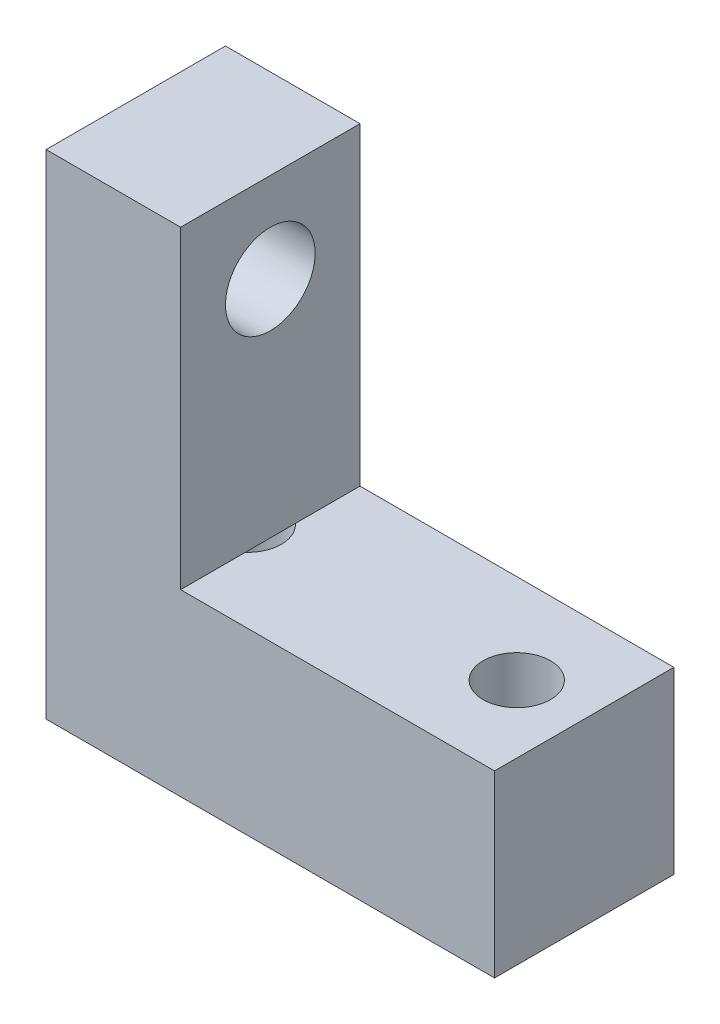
ISO-10303-21;
HEADER;
FILE_DESCRIPTION(('STEP AP214'),'2;1');
FILE_NAME('part.step','',(''),(''),'','','');
FILE_SCHEMA(('AUTOMOTIVE_DESIGN { 1 0 10303 214 1 1 1 1 }'));
ENDSEC;
DATA;
#1=APPLICATION_CONTEXT('core data for automotive mechanical design processes');
#2=APPLICATION_PROTOCOL_DEFINITION('international standard','automotive_design',2000,#1);
#3=PRODUCT_CONTEXT('',#1,'mechanical');
#4=PRODUCT('Part','Part','',(#3));
#5=PRODUCT_RELATED_PRODUCT_CATEGORY('part','',(#4));
#6=PRODUCT_DEFINITION_FORMATION('','',#4);
#7=PRODUCT_DEFINITION_CONTEXT('part definition',#1,'design');
#8=PRODUCT_DEFINITION('design','',#6,#7);
#9=PRODUCT_DEFINITION_SHAPE('','',#8);
#10=(LENGTH_UNIT() NAMED_UNIT(*) SI_UNIT(.MILLI.,.METRE.));
#11=(NAMED_UNIT(*) PLANE_ANGLE_UNIT() SI_UNIT($,.RADIAN.));
#12=(NAMED_UNIT(*) SI_UNIT($,.STERADIAN.) SOLID_ANGLE_UNIT());
#13=UNCERTAINTY_MEASURE_WITH_UNIT(LENGTH_MEASURE(1.E-05),#10,'distance_accuracy_value','');
#14=(GEOMETRIC_REPRESENTATION_CONTEXT(3) GLOBAL_UNCERTAINTY_ASSIGNED_CONTEXT((#13)) GLOBAL_UNIT_ASSIGNED_CONTEXT((#10,
#11,#12)) REPRESENTATION_CONTEXT('',''));
#15=CARTESIAN_POINT('',(0.,0.,0.));
#16=DIRECTION('',(0.,0.,1.));
#17=DIRECTION('',(1.,0.,0.));
#18=AXIS2_PLACEMENT_3D('',#15,#16,#17);
#19=CARTESIAN_POINT('',(0.,34.925,6.35));
#20=DIRECTION('',(1.,0.,0.));
#21=DIRECTION('',(0.,1.,0.));
#22=AXIS2_PLACEMENT_3D('',#19,#20,#21);
#23=PLANE('',#22);
#24=DIRECTION('',(0.,-1.,0.));
#25=VECTOR('',#24,1.);
#26=CARTESIAN_POINT('',(0.,34.925,-6.35));
#27=LINE('',#26,#25);
#28=CARTESIAN_POINT('',(0.,34.925,-6.35));
#29=VERTEX_POINT('',#28);
#30=CARTESIAN_POINT('',(0.,0.,-6.35));
#31=VERTEX_POINT('',#30);
#32=EDGE_CURVE('E132',#29,#31,#27,.T.);
#33=ORIENTED_EDGE('',*,*,#32,.T.);
#34=DIRECTION('',(0.,0.,-1.));
#35=VECTOR('',#34,1.);
#36=CARTESIAN_POINT('',(0.,0.,6.35));
#37=LINE('',#36,#35);
#38=CARTESIAN_POINT('',(0.,0.,6.35));
#39=VERTEX_POINT('',#38);
#40=EDGE_CURVE('E11',#39,#31,#37,.T.);
#41=ORIENTED_EDGE('',*,*,#40,.F.);
#42=DIRECTION('',(0.,-1.,0.));
#43=VECTOR('',#42,1.);
#44=CARTESIAN_POINT('',(0.,34.925,6.35));
#45=LINE('',#44,#43);
#46=CARTESIAN_POINT('',(0.,34.925,6.35));
#47=VERTEX_POINT('',#46);
#48=EDGE_CURVE('E145',#47,#39,#45,.T.);
#49=ORIENTED_EDGE('',*,*,#48,.F.);
#50=DIRECTION('',(0.,0.,-1.));
#51=VECTOR('',#50,1.);
#52=CARTESIAN_POINT('',(0.,34.925,6.35));
#53=LINE('',#52,#51);
#54=EDGE_CURVE('E128',#47,#29,#53,.T.);
#55=ORIENTED_EDGE('',*,*,#54,.T.);
#56=EDGE_LOOP('',(#33,#41,#49,#55));
#57=FACE_BOUND('',#56,.T.);
#58=CARTESIAN_POINT('',(0.,28.575,0.));
#59=DIRECTION('',(1.,0.,0.));
#60=DIRECTION('',(0.,0.,-1.));
#61=AXIS2_PLACEMENT_3D('',#58,#59,#60);
#62=CIRCLE('',#61,3.175);
#63=CARTESIAN_POINT('',(0.,28.575,-3.175));
#64=VERTEX_POINT('',#63);
#65=EDGE_CURVE('E187',#64,#64,#62,.T.);
#66=ORIENTED_EDGE('',*,*,#65,.T.);
#67=EDGE_LOOP('',(#66));
#68=FACE_BOUND('',#67,.T.);
#69=ADVANCED_FACE('F35',(#57,#68),#23,.F.);
#70=CARTESIAN_POINT('',(9.525,12.7,6.35));
#71=DIRECTION('',(-1.,0.,0.));
#72=DIRECTION('',(0.,-1.,0.));
#73=AXIS2_PLACEMENT_3D('',#70,#71,#72);
#74=PLANE('',#73);
#75=DIRECTION('',(0.,1.,0.));
#76=VECTOR('',#75,1.);
#77=CARTESIAN_POINT('',(9.525,12.7,-6.35));
#78=LINE('',#77,#76);
#79=CARTESIAN_POINT('',(9.525,12.7,-6.35));
#80=VERTEX_POINT('',#79);
#81=CARTESIAN_POINT('',(9.525,34.925,-6.35));
#82=VERTEX_POINT('',#81);
#83=EDGE_CURVE('E142',#80,#82,#78,.T.);
#84=ORIENTED_EDGE('',*,*,#83,.T.);
#85=DIRECTION('',(0.,0.,-1.));
#86=VECTOR('',#85,1.);
#87=CARTESIAN_POINT('',(9.525,34.925,6.35));
#88=LINE('',#87,#86);
#89=CARTESIAN_POINT('',(9.525,34.925,6.35));
#90=VERTEX_POINT('',#89);
#91=EDGE_CURVE('E126',#90,#82,#88,.T.);
#92=ORIENTED_EDGE('',*,*,#91,.F.);
#93=DIRECTION('',(0.,1.,0.));
#94=VECTOR('',#93,1.);
#95=CARTESIAN_POINT('',(9.525,12.7,6.35));
#96=LINE('',#95,#94);
#97=CARTESIAN_POINT('',(9.525,12.7,6.35));
#98=VERTEX_POINT('',#97);
#99=EDGE_CURVE('E105',#98,#90,#96,.T.);
#100=ORIENTED_EDGE('',*,*,#99,.F.);
#101=DIRECTION('',(0.,0.,-1.));
#102=VECTOR('',#101,1.);
#103=CARTESIAN_POINT('',(9.525,12.7,6.35));
#104=LINE('',#103,#102);
#105=CARTESIAN_POINT('',(9.525,12.7,1.77200274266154));
#106=VERTEX_POINT('',#105);
#107=EDGE_CURVE('E114',#98,#106,#104,.T.);
#108=ORIENTED_EDGE('',*,*,#107,.T.);
#109=CARTESIAN_POINT('',(9.525,12.7,-1.77200274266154));
#110=VERTEX_POINT('',#109);
#111=EDGE_CURVE('E121',#106,#110,#104,.T.);
#112=ORIENTED_EDGE('',*,*,#111,.T.);
#113=EDGE_CURVE('E123',#110,#80,#104,.T.);
#114=ORIENTED_EDGE('',*,*,#113,.T.);
#115=EDGE_LOOP('',(#84,#92,#100,#108,#112,#114));
#116=FACE_BOUND('',#115,.T.);
#117=CARTESIAN_POINT('',(9.525,28.575,0.));
#118=DIRECTION('',(-1.,0.,0.));
#119=DIRECTION('',(0.,-1.,0.));
#120=AXIS2_PLACEMENT_3D('',#117,#118,#119);
#121=CIRCLE('',#120,3.175);
#122=CARTESIAN_POINT('',(9.525,25.4,0.));
#123=VERTEX_POINT('',#122);
#124=EDGE_CURVE('E38',#123,#123,#121,.F.);
#125=ORIENTED_EDGE('',*,*,#124,.F.);
#126=EDGE_LOOP('',(#125));
#127=FACE_BOUND('',#126,.T.);
#128=ADVANCED_FACE('F124',(#116,#127),#74,.F.);
#129=CARTESIAN_POINT('',(0.,0.,6.35));
#130=DIRECTION('',(0.,1.,0.));
#131=DIRECTION('',(0.,0.,1.));
#132=AXIS2_PLACEMENT_3D('',#129,#130,#131);
#133=PLANE('',#132);
#134=CARTESIAN_POINT('',(7.9248,0.,0.));
#135=DIRECTION('',(0.,1.,0.));
#136=DIRECTION('',(0.,0.,1.));
#137=AXIS2_PLACEMENT_3D('',#134,#135,#136);
#138=CIRCLE('',#137,2.3876);
#139=CARTESIAN_POINT('',(7.9248,0.,2.3876));
#140=VERTEX_POINT('',#139);
#141=EDGE_CURVE('E164',#140,#140,#138,.T.);
#142=ORIENTED_EDGE('',*,*,#141,.T.);
#143=EDGE_LOOP('',(#142));
#144=FACE_BOUND('',#143,.T.);
#145=DIRECTION('',(1.,0.,0.));
#146=VECTOR('',#145,1.);
#147=CARTESIAN_POINT('',(0.,0.,-6.35));
#148=LINE('',#147,#146);
#149=CARTESIAN_POINT('',(31.75,0.,-6.35));
#150=VERTEX_POINT('',#149);
#151=EDGE_CURVE('E135',#31,#150,#148,.T.);
#152=ORIENTED_EDGE('',*,*,#151,.T.);
#153=DIRECTION('',(0.,0.,-1.));
#154=VECTOR('',#153,1.);
#155=CARTESIAN_POINT('',(31.75,0.,6.35));
#156=LINE('',#155,#154);
#157=CARTESIAN_POINT('',(31.75,0.,6.35));
#158=VERTEX_POINT('',#157);
#159=EDGE_CURVE('E43',#158,#150,#156,.T.);
#160=ORIENTED_EDGE('',*,*,#159,.F.);
#161=DIRECTION('',(1.,0.,0.));
#162=VECTOR('',#161,1.);
#163=CARTESIAN_POINT('',(0.,0.,6.35));
#164=LINE('',#163,#162);
#165=EDGE_CURVE('E93',#39,#158,#164,.T.);
#166=ORIENTED_EDGE('',*,*,#165,.F.);
#167=ORIENTED_EDGE('',*,*,#40,.T.);
#168=EDGE_LOOP('',(#152,#160,#166,#167));
#169=FACE_BOUND('',#168,.T.);
#170=CARTESIAN_POINT('',(26.9748,0.,0.));
#171=DIRECTION('',(0.,1.,0.));
#172=DIRECTION('',(0.,0.,1.));
#173=AXIS2_PLACEMENT_3D('',#170,#171,#172);
#174=CIRCLE('',#173,2.3876);
#175=CARTESIAN_POINT('',(26.9748,0.,2.3876));
#176=VERTEX_POINT('',#175);
#177=EDGE_CURVE('E170',#176,#176,#174,.T.);
#178=ORIENTED_EDGE('',*,*,#177,.T.);
#179=EDGE_LOOP('',(#178));
#180=FACE_BOUND('',#179,.T.);
#181=ADVANCED_FACE('F178',(#144,#169,#180),#133,.F.);
#182=CARTESIAN_POINT('',(31.75,12.7,6.35));
#183=DIRECTION('',(0.,-1.,0.));
#184=DIRECTION('',(1.,0.,0.));
#185=AXIS2_PLACEMENT_3D('',#182,#183,#184);
#186=PLANE('',#185);
#187=CARTESIAN_POINT('',(7.9248,12.7,0.));
#188=DIRECTION('',(0.,1.,0.));
#189=DIRECTION('',(0.,0.,1.));
#190=AXIS2_PLACEMENT_3D('',#187,#188,#189);
#191=CIRCLE('',#190,2.3876);
#192=EDGE_CURVE('E49',#106,#110,#191,.T.);
#193=ORIENTED_EDGE('',*,*,#192,.F.);
#194=ORIENTED_EDGE('',*,*,#107,.F.);
#195=DIRECTION('',(-1.,0.,0.));
#196=VECTOR('',#195,1.);
#197=CARTESIAN_POINT('',(31.75,12.7,6.35));
#198=LINE('',#197,#196);
#199=CARTESIAN_POINT('',(31.75,12.7,6.35));
#200=VERTEX_POINT('',#199);
#201=EDGE_CURVE('E101',#200,#98,#198,.T.);
#202=ORIENTED_EDGE('',*,*,#201,.F.);
#203=DIRECTION('',(0.,0.,-1.));
#204=VECTOR('',#203,1.);
#205=CARTESIAN_POINT('',(31.75,12.7,6.35));
#206=LINE('',#205,#204);
#207=CARTESIAN_POINT('',(31.75,12.7,-6.35));
#208=VERTEX_POINT('',#207);
#209=EDGE_CURVE('E120',#200,#208,#206,.T.);
#210=ORIENTED_EDGE('',*,*,#209,.T.);
#211=DIRECTION('',(-1.,0.,0.));
#212=VECTOR('',#211,1.);
#213=CARTESIAN_POINT('',(31.75,12.7,-6.35));
#214=LINE('',#213,#212);
#215=EDGE_CURVE('E139',#208,#80,#214,.T.);
#216=ORIENTED_EDGE('',*,*,#215,.T.);
#217=ORIENTED_EDGE('',*,*,#113,.F.);
#218=EDGE_LOOP('',(#193,#194,#202,#210,#216,#217));
#219=FACE_BOUND('',#218,.T.);
#220=CARTESIAN_POINT('',(26.9748,12.7,0.));
#221=DIRECTION('',(0.,1.,0.));
#222=DIRECTION('',(0.,0.,1.));
#223=AXIS2_PLACEMENT_3D('',#220,#221,#222);
#224=CIRCLE('',#223,2.3876);
#225=CARTESIAN_POINT('',(26.9748,12.7,2.3876));
#226=VERTEX_POINT('',#225);
#227=EDGE_CURVE('E167',#226,#226,#224,.T.);
#228=ORIENTED_EDGE('',*,*,#227,.F.);
#229=EDGE_LOOP('',(#228));
#230=FACE_BOUND('',#229,.T.);
#231=ADVANCED_FACE('F115',(#219,#230),#186,.F.);
#232=CARTESIAN_POINT('',(31.75,0.,6.35));
#233=DIRECTION('',(-1.,0.,0.));
#234=DIRECTION('',(0.,0.,1.));
#235=AXIS2_PLACEMENT_3D('',#232,#233,#234);
#236=PLANE('',#235);
#237=DIRECTION('',(0.,1.,0.));
#238=VECTOR('',#237,1.);
#239=CARTESIAN_POINT('',(31.75,0.,-6.35));
#240=LINE('',#239,#238);
#241=EDGE_CURVE('E137',#150,#208,#240,.T.);
#242=ORIENTED_EDGE('',*,*,#241,.T.);
#243=ORIENTED_EDGE('',*,*,#209,.F.);
#244=DIRECTION('',(0.,1.,0.));
#245=VECTOR('',#244,1.);
#246=CARTESIAN_POINT('',(31.75,0.,6.35));
#247=LINE('',#246,#245);
#248=EDGE_CURVE('E108',#158,#200,#247,.T.);
#249=ORIENTED_EDGE('',*,*,#248,.F.);
#250=ORIENTED_EDGE('',*,*,#159,.T.);
#251=EDGE_LOOP('',(#242,#243,#249,#250));
#252=FACE_BOUND('',#251,.T.);
#253=ADVANCED_FACE('F152',(#252),#236,.F.);
#254=CARTESIAN_POINT('',(9.525,34.925,6.35));
#255=DIRECTION('',(0.,-1.,0.));
#256=DIRECTION('',(0.,0.,-1.));
#257=AXIS2_PLACEMENT_3D('',#254,#255,#256);
#258=PLANE('',#257);
#259=DIRECTION('',(-1.,0.,0.));
#260=VECTOR('',#259,1.);
#261=CARTESIAN_POINT('',(9.525,34.925,-6.35));
#262=LINE('',#261,#260);
#263=EDGE_CURVE('E85',#82,#29,#262,.T.);
#264=ORIENTED_EDGE('',*,*,#263,.T.);
#265=ORIENTED_EDGE('',*,*,#54,.F.);
#266=DIRECTION('',(-1.,0.,0.));
#267=VECTOR('',#266,1.);
#268=CARTESIAN_POINT('',(9.525,34.925,6.35));
#269=LINE('',#268,#267);
#270=EDGE_CURVE('E58',#90,#47,#269,.T.);
#271=ORIENTED_EDGE('',*,*,#270,.F.);
#272=ORIENTED_EDGE('',*,*,#91,.T.);
#273=EDGE_LOOP('',(#264,#265,#271,#272));
#274=FACE_BOUND('',#273,.T.);
#275=ADVANCED_FACE('F212',(#274),#258,.F.);
#276=CARTESIAN_POINT('',(0.,0.,6.35));
#277=DIRECTION('',(0.,0.,1.));
#278=DIRECTION('',(1.,0.,0.));
#279=AXIS2_PLACEMENT_3D('',#276,#277,#278);
#280=PLANE('',#279);
#281=ORIENTED_EDGE('',*,*,#48,.T.);
#282=ORIENTED_EDGE('',*,*,#165,.T.);
#283=ORIENTED_EDGE('',*,*,#248,.T.);
#284=ORIENTED_EDGE('',*,*,#201,.T.);
#285=ORIENTED_EDGE('',*,*,#99,.T.);
#286=ORIENTED_EDGE('',*,*,#270,.T.);
#287=EDGE_LOOP('',(#281,#282,#283,#284,#285,#286));
#288=FACE_BOUND('',#287,.T.);
#289=ADVANCED_FACE('F103',(#288),#280,.T.);
#290=CARTESIAN_POINT('',(0.,0.,-6.35));
#291=DIRECTION('',(0.,0.,1.));
#292=DIRECTION('',(1.,0.,0.));
#293=AXIS2_PLACEMENT_3D('',#290,#291,#292);
#294=PLANE('',#293);
#295=ORIENTED_EDGE('',*,*,#32,.F.);
#296=ORIENTED_EDGE('',*,*,#263,.F.);
#297=ORIENTED_EDGE('',*,*,#83,.F.);
#298=ORIENTED_EDGE('',*,*,#215,.F.);
#299=ORIENTED_EDGE('',*,*,#241,.F.);
#300=ORIENTED_EDGE('',*,*,#151,.F.);
#301=EDGE_LOOP('',(#295,#296,#297,#298,#299,#300));
#302=FACE_BOUND('',#301,.T.);
#303=ADVANCED_FACE('F156',(#302),#294,.F.);
#304=CARTESIAN_POINT('',(7.9248,12.7,0.));
#305=DIRECTION('',(0.,1.,0.));
#306=DIRECTION('',(0.,0.,1.));
#307=AXIS2_PLACEMENT_3D('',#304,#305,#306);
#308=PLANE('',#307);
#309=EDGE_CURVE('E161',#110,#106,#191,.T.);
#310=ORIENTED_EDGE('',*,*,#309,.F.);
#311=ORIENTED_EDGE('',*,*,#111,.F.);
#312=EDGE_LOOP('',(#310,#311));
#313=FACE_BOUND('',#312,.T.);
#314=ADVANCED_FACE('F160',(#313),#308,.F.);
#315=CARTESIAN_POINT('',(7.9248,12.7,0.));
#316=DIRECTION('',(0.,-1.,0.));
#317=DIRECTION('',(0.,0.,-1.));
#318=AXIS2_PLACEMENT_3D('',#315,#316,#317);
#319=CYLINDRICAL_SURFACE('',#318,2.3876);
#320=ORIENTED_EDGE('',*,*,#192,.T.);
#321=ORIENTED_EDGE('',*,*,#309,.T.);
#322=EDGE_LOOP('',(#320,#321));
#323=FACE_BOUND('',#322,.T.);
#324=ORIENTED_EDGE('',*,*,#141,.F.);
#325=EDGE_LOOP('',(#324));
#326=FACE_BOUND('',#325,.T.);
#327=ADVANCED_FACE('F162',(#323,#326),#319,.F.);
#328=CARTESIAN_POINT('',(26.9748,12.7,0.));
#329=DIRECTION('',(0.,-1.,0.));
#330=DIRECTION('',(0.,0.,-1.));
#331=AXIS2_PLACEMENT_3D('',#328,#329,#330);
#332=CYLINDRICAL_SURFACE('',#331,2.3876);
#333=ORIENTED_EDGE('',*,*,#227,.T.);
#334=EDGE_LOOP('',(#333));
#335=FACE_BOUND('',#334,.T.);
#336=ORIENTED_EDGE('',*,*,#177,.F.);
#337=EDGE_LOOP('',(#336));
#338=FACE_BOUND('',#337,.T.);
#339=ADVANCED_FACE('F196',(#335,#338),#332,.F.);
#340=CARTESIAN_POINT('',(17.78,28.575,0.));
#341=DIRECTION('',(-1.,0.,0.));
#342=DIRECTION('',(0.,0.,1.));
#343=AXIS2_PLACEMENT_3D('',#340,#341,#342);
#344=CYLINDRICAL_SURFACE('',#343,3.175);
#345=ORIENTED_EDGE('',*,*,#65,.F.);
#346=EDGE_LOOP('',(#345));
#347=FACE_BOUND('',#346,.T.);
#348=ORIENTED_EDGE('',*,*,#124,.T.);
#349=EDGE_LOOP('',(#348));
#350=FACE_BOUND('',#349,.T.);
#351=ADVANCED_FACE('F194',(#347,#350),#344,.F.);
#352=CLOSED_SHELL('',(#69,#128,#181,#231,#253,#275,#289,#303,#314,#327,#339,#351));
#353=MANIFOLD_SOLID_BREP('B2',#352);
#354=ADVANCED_BREP_SHAPE_REPRESENTATION('',(#18,#353),#14);
#355=SHAPE_DEFINITION_REPRESENTATION(#9,#354);
ENDSEC;
END-ISO-10303-21;
